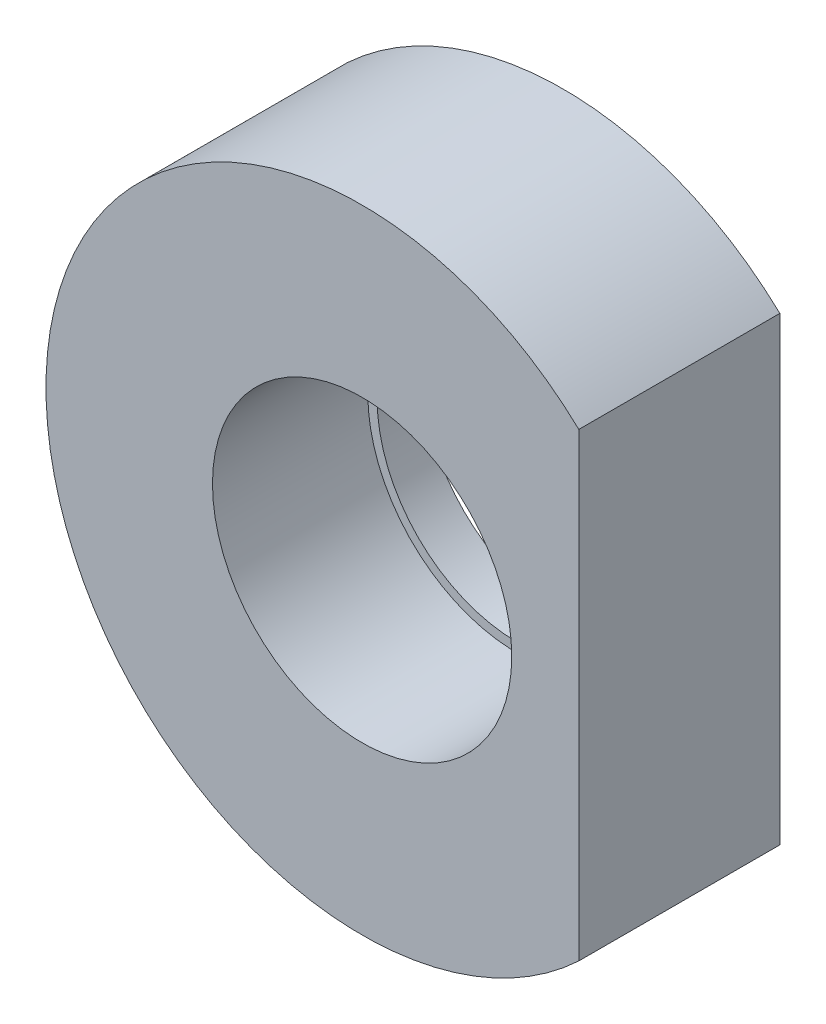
ISO-10303-21;
HEADER;
FILE_DESCRIPTION(('STEP AP214'),'2;1');
FILE_NAME('part.step','',(''),(''),'','','');
FILE_SCHEMA(('AUTOMOTIVE_DESIGN { 1 0 10303 214 1 1 1 1 }'));
ENDSEC;
DATA;
#1=APPLICATION_CONTEXT('core data for automotive mechanical design processes');
#2=APPLICATION_PROTOCOL_DEFINITION('international standard','automotive_design',2000,#1);
#3=PRODUCT_CONTEXT('',#1,'mechanical');
#4=PRODUCT('Part','Part','',(#3));
#5=PRODUCT_RELATED_PRODUCT_CATEGORY('part','',(#4));
#6=PRODUCT_DEFINITION_FORMATION('','',#4);
#7=PRODUCT_DEFINITION_CONTEXT('part definition',#1,'design');
#8=PRODUCT_DEFINITION('design','',#6,#7);
#9=PRODUCT_DEFINITION_SHAPE('','',#8);
#10=(LENGTH_UNIT() NAMED_UNIT(*) SI_UNIT(.MILLI.,.METRE.));
#11=(NAMED_UNIT(*) PLANE_ANGLE_UNIT() SI_UNIT($,.RADIAN.));
#12=(NAMED_UNIT(*) SI_UNIT($,.STERADIAN.) SOLID_ANGLE_UNIT());
#13=UNCERTAINTY_MEASURE_WITH_UNIT(LENGTH_MEASURE(1.E-05),#10,'distance_accuracy_value','');
#14=(GEOMETRIC_REPRESENTATION_CONTEXT(3) GLOBAL_UNCERTAINTY_ASSIGNED_CONTEXT((#13)) GLOBAL_UNIT_ASSIGNED_CONTEXT((#10,
#11,#12)) REPRESENTATION_CONTEXT('',''));
#15=CARTESIAN_POINT('',(0.,0.,0.));
#16=DIRECTION('',(0.,0.,1.));
#17=DIRECTION('',(1.,0.,0.));
#18=AXIS2_PLACEMENT_3D('',#15,#16,#17);
#19=CARTESIAN_POINT('',(0.,-10.4013,3.175));
#20=DIRECTION('',(0.,0.,-1.));
#21=DIRECTION('',(0.,1.,0.));
#22=AXIS2_PLACEMENT_3D('',#19,#20,#21);
#23=PLANE('',#22);
#24=CARTESIAN_POINT('',(0.,0.,3.175));
#25=DIRECTION('',(0.,0.,1.));
#26=DIRECTION('',(1.,0.,0.));
#27=AXIS2_PLACEMENT_3D('',#24,#25,#26);
#28=CIRCLE('',#27,9.75);
#29=CARTESIAN_POINT('',(9.75,0.,3.175));
#30=VERTEX_POINT('',#29);
#31=EDGE_CURVE('E61',#30,#30,#28,.T.);
#32=ORIENTED_EDGE('',*,*,#31,.F.);
#33=EDGE_LOOP('',(#32));
#34=FACE_BOUND('',#33,.T.);
#35=CARTESIAN_POINT('',(0.,0.,3.175));
#36=DIRECTION('',(0.,0.,-1.));
#37=DIRECTION('',(-1.,0.,0.));
#38=AXIS2_PLACEMENT_3D('',#35,#36,#37);
#39=CIRCLE('',#38,10.4);
#40=CARTESIAN_POINT('',(-10.4,0.,3.175));
#41=VERTEX_POINT('',#40);
#42=EDGE_CURVE('E9',#41,#41,#39,.T.);
#43=ORIENTED_EDGE('',*,*,#42,.F.);
#44=EDGE_LOOP('',(#43));
#45=FACE_BOUND('',#44,.T.);
#46=ADVANCED_FACE('F14',(#34,#45),#23,.F.);
#47=CARTESIAN_POINT('',(0.,0.,13.97));
#48=DIRECTION('',(0.,0.,-1.));
#49=DIRECTION('',(0.,1.,0.));
#50=AXIS2_PLACEMENT_3D('',#47,#48,#49);
#51=CYLINDRICAL_SURFACE('',#50,21.971);
#52=DIRECTION('',(0.,0.,-1.));
#53=VECTOR('',#52,1.);
#54=CARTESIAN_POINT('',(15.0622,-15.9954672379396,97.0803335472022));
#55=LINE('',#54,#53);
#56=CARTESIAN_POINT('',(15.0622,-15.9954672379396,13.97));
#57=VERTEX_POINT('',#56);
#58=CARTESIAN_POINT('',(15.0622,-15.9954672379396,0.));
#59=VERTEX_POINT('',#58);
#60=EDGE_CURVE('E35',#57,#59,#55,.T.);
#61=ORIENTED_EDGE('',*,*,#60,.F.);
#62=CARTESIAN_POINT('',(0.,0.,13.97));
#63=DIRECTION('',(0.,0.,1.));
#64=DIRECTION('',(0.,-1.,0.));
#65=AXIS2_PLACEMENT_3D('',#62,#63,#64);
#66=CIRCLE('',#65,21.971);
#67=CARTESIAN_POINT('',(15.0622,15.9954672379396,13.97));
#68=VERTEX_POINT('',#67);
#69=EDGE_CURVE('E47',#68,#57,#66,.T.);
#70=ORIENTED_EDGE('',*,*,#69,.F.);
#71=DIRECTION('',(0.,0.,-1.));
#72=VECTOR('',#71,1.);
#73=CARTESIAN_POINT('',(15.0622,15.9954672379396,97.0803335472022));
#74=LINE('',#73,#72);
#75=CARTESIAN_POINT('',(15.0622,15.9954672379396,0.));
#76=VERTEX_POINT('',#75);
#77=EDGE_CURVE('E50',#68,#76,#74,.T.);
#78=ORIENTED_EDGE('',*,*,#77,.T.);
#79=CARTESIAN_POINT('',(0.,0.,0.));
#80=DIRECTION('',(0.,0.,1.));
#81=DIRECTION('',(0.,-1.,0.));
#82=AXIS2_PLACEMENT_3D('',#79,#80,#81);
#83=CIRCLE('',#82,21.971);
#84=EDGE_CURVE('E42',#76,#59,#83,.T.);
#85=ORIENTED_EDGE('',*,*,#84,.T.);
#86=EDGE_LOOP('',(#61,#70,#78,#85));
#87=FACE_BOUND('',#86,.T.);
#88=ADVANCED_FACE('F16',(#87),#51,.T.);
#89=CARTESIAN_POINT('',(0.,0.,13.97));
#90=DIRECTION('',(0.,0.,1.));
#91=DIRECTION('',(0.,-1.,0.));
#92=AXIS2_PLACEMENT_3D('',#89,#90,#91);
#93=PLANE('',#92);
#94=ORIENTED_EDGE('',*,*,#69,.T.);
#95=DIRECTION('',(0.,1.,0.));
#96=VECTOR('',#95,1.);
#97=CARTESIAN_POINT('',(15.0622,0.,13.97));
#98=LINE('',#97,#96);
#99=EDGE_CURVE('E28',#57,#68,#98,.T.);
#100=ORIENTED_EDGE('',*,*,#99,.T.);
#101=EDGE_LOOP('',(#94,#100));
#102=FACE_BOUND('',#101,.T.);
#103=CARTESIAN_POINT('',(0.,0.,13.97));
#104=DIRECTION('',(0.,0.,1.));
#105=DIRECTION('',(1.,0.,0.));
#106=AXIS2_PLACEMENT_3D('',#103,#104,#105);
#107=CIRCLE('',#106,10.4);
#108=CARTESIAN_POINT('',(10.4,0.,13.97));
#109=VERTEX_POINT('',#108);
#110=EDGE_CURVE('E64',#109,#109,#107,.T.);
#111=ORIENTED_EDGE('',*,*,#110,.F.);
#112=EDGE_LOOP('',(#111));
#113=FACE_BOUND('',#112,.T.);
#114=ADVANCED_FACE('F71',(#102,#113),#93,.T.);
#115=CARTESIAN_POINT('',(0.,0.,0.));
#116=DIRECTION('',(0.,0.,1.));
#117=DIRECTION('',(0.,-1.,0.));
#118=AXIS2_PLACEMENT_3D('',#115,#116,#117);
#119=PLANE('',#118);
#120=DIRECTION('',(0.,1.,0.));
#121=VECTOR('',#120,1.);
#122=CARTESIAN_POINT('',(15.0622,0.,0.));
#123=LINE('',#122,#121);
#124=EDGE_CURVE('E22',#59,#76,#123,.T.);
#125=ORIENTED_EDGE('',*,*,#124,.F.);
#126=ORIENTED_EDGE('',*,*,#84,.F.);
#127=EDGE_LOOP('',(#125,#126));
#128=FACE_BOUND('',#127,.T.);
#129=CARTESIAN_POINT('',(0.,0.,0.));
#130=DIRECTION('',(0.,0.,1.));
#131=DIRECTION('',(1.,0.,0.));
#132=AXIS2_PLACEMENT_3D('',#129,#130,#131);
#133=CIRCLE('',#132,9.75);
#134=CARTESIAN_POINT('',(9.75,0.,0.));
#135=VERTEX_POINT('',#134);
#136=EDGE_CURVE('E52',#135,#135,#133,.F.);
#137=ORIENTED_EDGE('',*,*,#136,.F.);
#138=EDGE_LOOP('',(#137));
#139=FACE_BOUND('',#138,.T.);
#140=ADVANCED_FACE('F44',(#128,#139),#119,.F.);
#141=CARTESIAN_POINT('',(15.0622,15.9954672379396,97.0803335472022));
#142=DIRECTION('',(1.,0.,0.));
#143=DIRECTION('',(0.,0.,1.));
#144=AXIS2_PLACEMENT_3D('',#141,#142,#143);
#145=PLANE('',#144);
#146=ORIENTED_EDGE('',*,*,#99,.F.);
#147=ORIENTED_EDGE('',*,*,#60,.T.);
#148=ORIENTED_EDGE('',*,*,#124,.T.);
#149=ORIENTED_EDGE('',*,*,#77,.F.);
#150=EDGE_LOOP('',(#146,#147,#148,#149));
#151=FACE_BOUND('',#150,.T.);
#152=ADVANCED_FACE('F54',(#151),#145,.T.);
#153=CARTESIAN_POINT('',(0.,0.,-30.718154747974));
#154=DIRECTION('',(0.,0.,1.));
#155=DIRECTION('',(1.,0.,0.));
#156=AXIS2_PLACEMENT_3D('',#153,#154,#155);
#157=CYLINDRICAL_SURFACE('',#156,9.75);
#158=ORIENTED_EDGE('',*,*,#136,.T.);
#159=EDGE_LOOP('',(#158));
#160=FACE_BOUND('',#159,.T.);
#161=ORIENTED_EDGE('',*,*,#31,.T.);
#162=EDGE_LOOP('',(#161));
#163=FACE_BOUND('',#162,.T.);
#164=ADVANCED_FACE('F90',(#160,#163),#157,.F.);
#165=CARTESIAN_POINT('',(0.,0.,-30.334368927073));
#166=DIRECTION('',(0.,0.,1.));
#167=DIRECTION('',(1.,0.,0.));
#168=AXIS2_PLACEMENT_3D('',#165,#166,#167);
#169=CYLINDRICAL_SURFACE('',#168,10.4);
#170=ORIENTED_EDGE('',*,*,#110,.T.);
#171=EDGE_LOOP('',(#170));
#172=FACE_BOUND('',#171,.T.);
#173=ORIENTED_EDGE('',*,*,#42,.T.);
#174=EDGE_LOOP('',(#173));
#175=FACE_BOUND('',#174,.T.);
#176=ADVANCED_FACE('F68',(#172,#175),#169,.F.);
#177=CLOSED_SHELL('',(#46,#88,#114,#140,#152,#164,#176));
#178=MANIFOLD_SOLID_BREP('B1',#177);
#179=ADVANCED_BREP_SHAPE_REPRESENTATION('',(#18,#178),#14);
#180=SHAPE_DEFINITION_REPRESENTATION(#9,#179);
ENDSEC;
END-ISO-10303-21;
